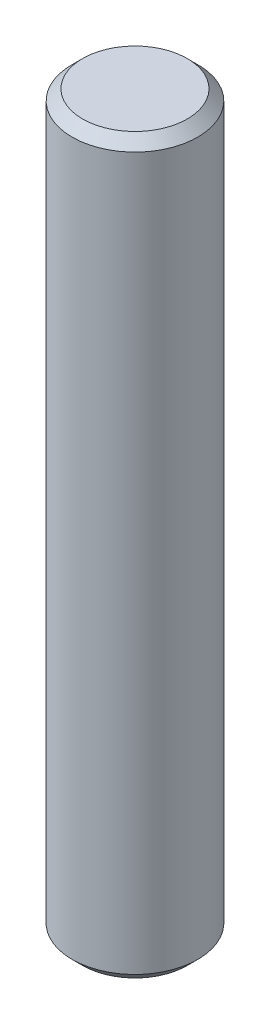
from build123d import *

# Parameters (mm, degrees)
ESQUISSE1_R        = 3
BOSS_EXTRU_1_DEPTH = 35
CHANFREIN1_SIZE    = 0.5


with BuildPart() as part:
    # Esquisse1 → Boss.-Extru.1 (new body)
    with BuildSketch(Plane(origin=(0, 0, 0), x_dir=(1, 0, 0), z_dir=(0, 1, 0))):
        with Locations(Location((0, 0, 0), (0, 0, 270))):
            Circle(ESQUISSE1_R)
    extrude(amount=BOSS_EXTRU_1_DEPTH)

    # Chanfrein1
    chanfrein1_edges = [part.edges().sort_by_distance(p)[0] for p in [
        (0, 0, -3),
        (0, 35, -3),
    ]]
    chamfer(chanfrein1_edges, length=CHANFREIN1_SIZE)


solid = part.part
